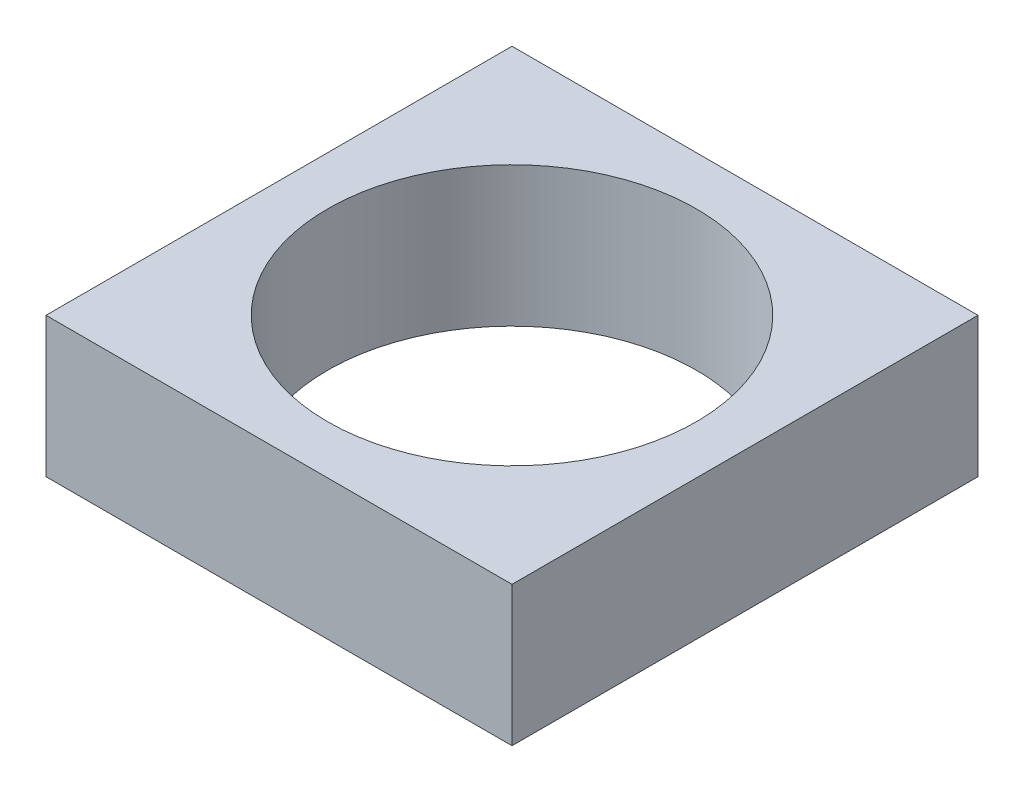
from build123d import *

# Parameters (mm, degrees)
ESQUISSE1_W        = 1000
ESQUISSE1_H        = 1000
ESQUISSE1_R        = 395.691608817
BOSS_EXTRU_1_DEPTH = 300


with BuildPart() as part:
    # Esquisse1 → Boss.-Extru.1 (new body)
    with BuildSketch(Plane(origin=(0, 0, 0), x_dir=(1, 0, 0), z_dir=(0, 1, 0))):
        Rectangle(ESQUISSE1_W, ESQUISSE1_H)
        with Locations(Location((0, 0, 0), (0, 0, 270))):
            Circle(ESQUISSE1_R, mode=Mode.SUBTRACT)
    extrude(amount=BOSS_EXTRU_1_DEPTH)


solid = part.part
